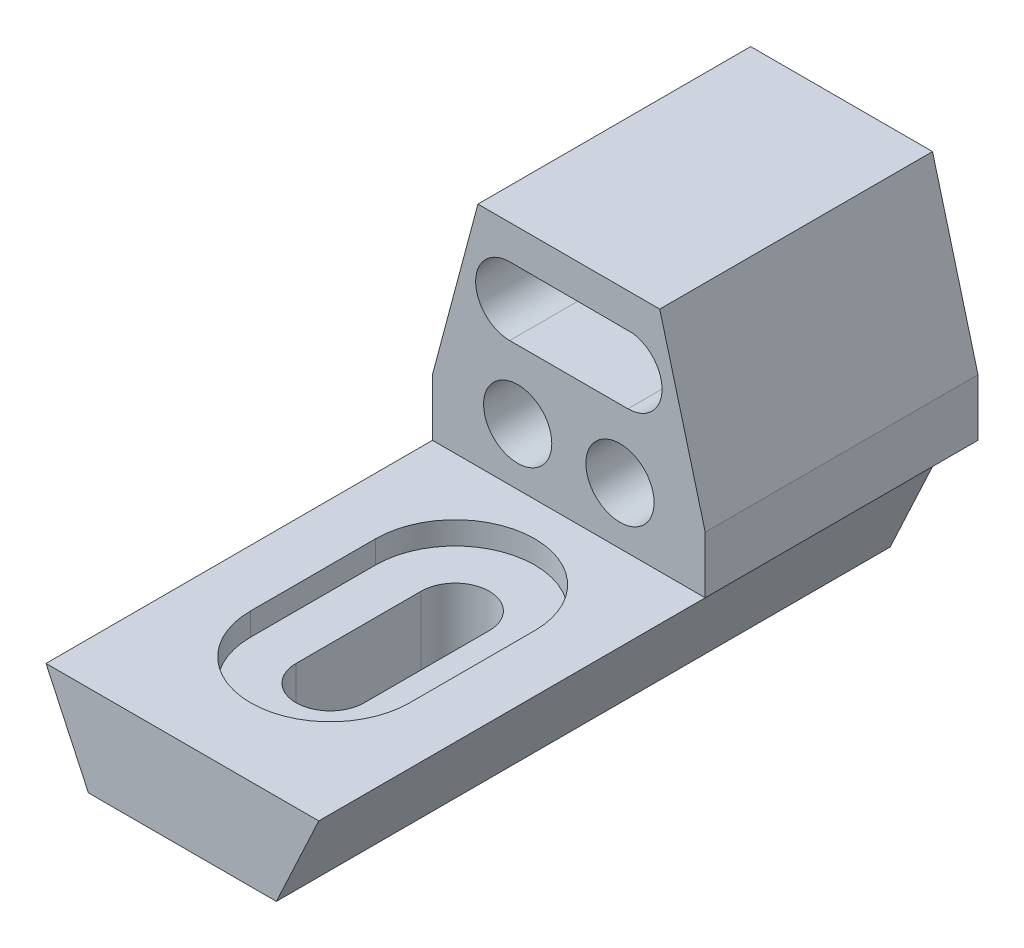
from build123d import *

# Parameters (mm, degrees)
BOSS_EXTRUDE1_DEPTH = 6858
CUT_EXTRUDE1_DEPTH  = 254
CUT_EXTRUDE2_DEPTH  = 7544.415141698
BOSS_EXTRUDE2_DEPTH = 3048
SKETCH5_R           = 381
CUT_EXTRUDE3_DEPTH  = 5865.045361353


with BuildPart() as part:
    # Sketch1 → Boss-Extrude1 (new body)
    with BuildSketch(Plane.XY):
        Polygon((0, 0), (3048, 0), (2574.231419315, -1016), (473.768580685, -1016), align=None)
    extrude(amount=-BOSS_EXTRUDE1_DEPTH)

    # Sketch2 → Cut-Extrude1 (cut)
    with BuildSketch(Plane(origin=(0, 0, 0), x_dir=(1, 0, 0), z_dir=(0, 1, 0))):
        with BuildLine():
            Line((635, 3048), (635, 1651))
            ThreePointArc((635, 1651), (1524, 762), (2413, 1651))
            Line((2413, 1651), (2413, 3048))
            ThreePointArc((2413, 3048), (1524, 3937), (635, 3048))
        make_face()
    extrude(amount=-CUT_EXTRUDE1_DEPTH, mode=Mode.SUBTRACT)

    # Sketch3 → Cut-Extrude2 (cut, through all)
    with BuildSketch(Plane(origin=(0, -254, 0), x_dir=(1, 0, 0), z_dir=(0, 1, 0))):
        with BuildLine():
            Line((1143, 3048), (1143, 1651))
            ThreePointArc((1143, 1651), (1524, 1270), (1905, 1651))
            Line((1905, 1651), (1905, 3048))
            ThreePointArc((1905, 3048), (1524, 3429), (1143, 3048))
        make_face()
    extrude(amount=-CUT_EXTRUDE2_DEPTH, mode=Mode.SUBTRACT)

    # Sketch4 → Boss-Extrude2 (add)
    with BuildSketch(Plane.XY.offset(-4318)):
        Polygon((0, 0), (0, 635), (508, 2540), (1524, 2540), (2540, 2540), (3048, 635), (3048, 0), align=None)
    extrude(amount=-BOSS_EXTRUDE2_DEPTH)

    # Sketch5 → Cut-Extrude3 (cut, through all)
    with BuildSketch(Plane.XY.offset(-4318)):
        with BuildLine():
            Line((865.883998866, 2158.99315394), (863.6, 2159))
            ThreePointArc((863.6, 2159), (482.6, 1778), (863.6, 1397))
            Line((863.6, 1397), (2184.4, 1397))
            ThreePointArc((2184.4, 1397), (2564.366951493, 1749.962243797), (2240.323468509, 2154.873408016))
            Line((2240.323468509, 2154.873408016), (2130.736797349, 2155.201883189))
            Line((2130.736797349, 2155.201883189), (865.883998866, 2158.99315394))
        make_face()
        with Locations((952.5, 635)):
            Circle(SKETCH5_R)
        with Locations((2095.5, 635)):
            Circle(SKETCH5_R)
    extrude(amount=-CUT_EXTRUDE3_DEPTH, mode=Mode.SUBTRACT)


solid = part.part
